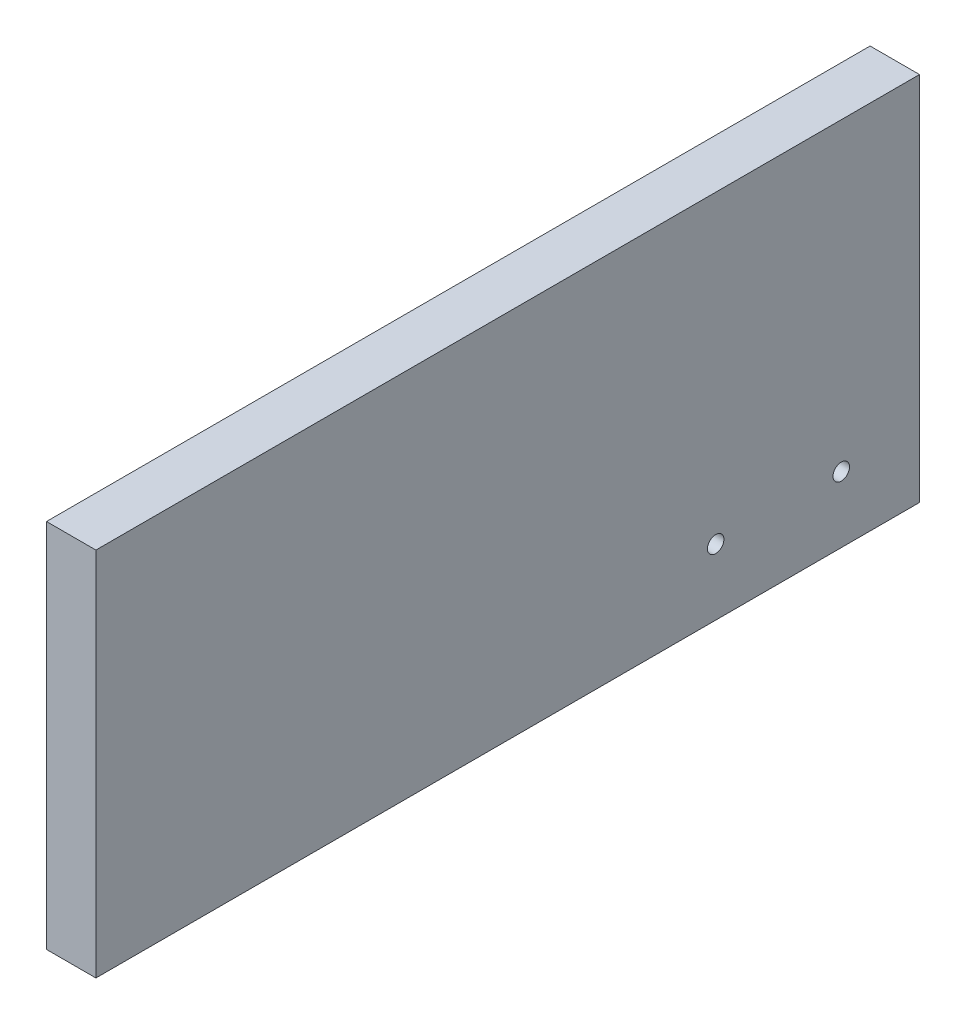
from build123d import *

# Parameters (mm, degrees)
SKETCH2_W           = 38.1
SKETCH2_H           = 285.75
BOSS_EXTRUDE2_DEPTH = 635
SKETCH3_R           = 6.35
CUT_EXTRUDE1_DEPTH  = 698.373409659


with BuildPart() as part:
    # Sketch2 → Boss-Extrude2 (new body)
    with BuildSketch(Plane.XY):
        with Locations((19.05, 142.875)):
            Rectangle(SKETCH2_W, SKETCH2_H)
    extrude(amount=BOSS_EXTRUDE2_DEPTH)

    # Sketch3 → Cut-Extrude1 (cut, through all)
    with BuildSketch(Plane(origin=(38.1, 0, 0), x_dir=(0, 0, -1), z_dir=(1, 0, 0))):
        with Locations(Location((-157.1625, 50.8, 0), (0, 0, 90))):
            Circle(SKETCH3_R)
        with Locations(Location((-60.325, 50.8, 0), (0, 0, 90))):
            Circle(SKETCH3_R)
    extrude(amount=-CUT_EXTRUDE1_DEPTH, mode=Mode.SUBTRACT)


solid = part.part
